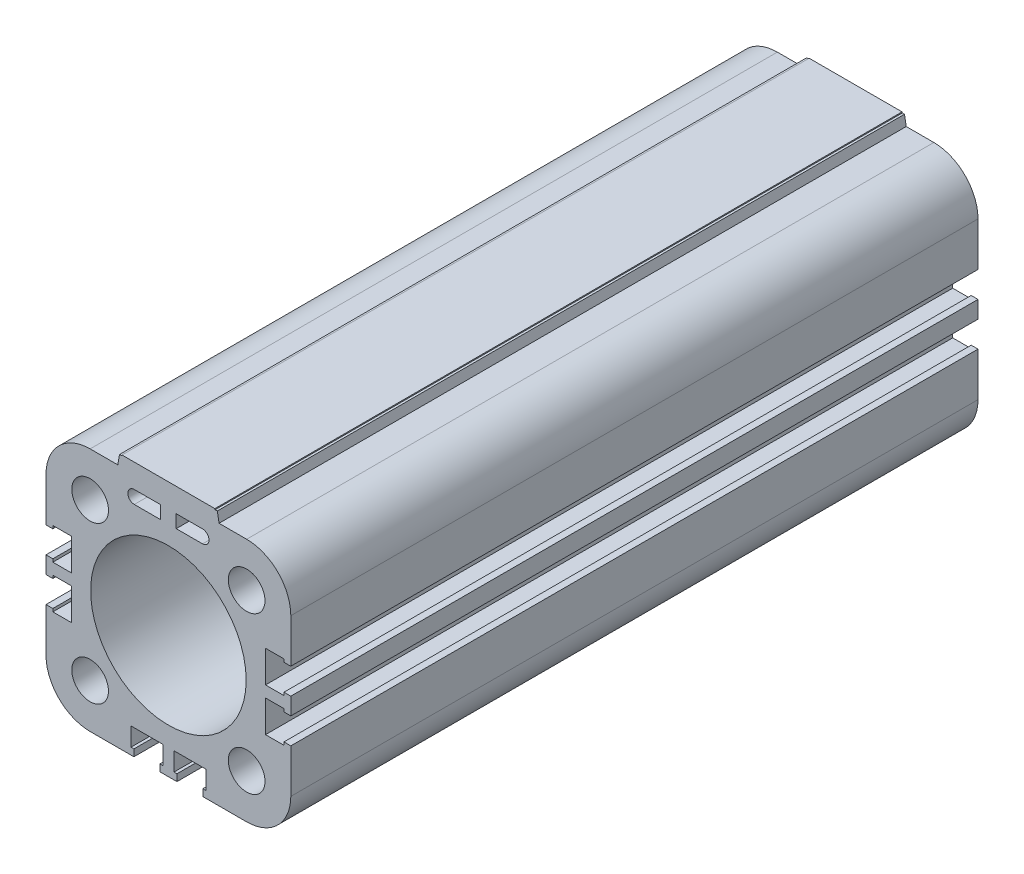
from build123d import *

# Parameters (mm, degrees)
ESQUISSE1_R                         = 3.75
ESQUISSE1_R_2                       = 15.9
EXTRUSION1_DEPTH                    = 70.25
EXTRUSION2_DEPTH                    = 70.25
EXTRUSION2_DEPTH_BACK               = 70.25
ENL_V_MAT_EXTRU_1_DEPTH             = 80.378089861
R_P_TITION_CIRCULAIRE1_COUNT        = 3
R_P_TITION_CIRCULAIRE1_ANGLE        = 180
R_P_TITION_CIRCULAIRE1_COPY_1_DEPTH = 80.378089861
R_P_TITION_CIRCULAIRE1_COPY_2_DEPTH = 80.378089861
ESQUISSE6_W                         = 8.125
ESQUISSE6_H                         = 9.982142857
ENL_V_MAT_EXTRU_3_DEPTH             = 0.2


with BuildPart() as part:
    # Esquisse1 → Extrusion1 (new, symmetric)
    with BuildSketch(Plane.XY):
        with BuildLine():
            Line((-16, 25.025), (-10.1, 25.025))
            Line((-10.1, 25.025), (-9.5, 27.195))
            Line((-9.5, 27.195), (9.5, 27.195))
            Line((9.5, 27.195), (10.1, 25.025))
            Line((10.1, 25.025), (16, 25.025))
            ThreePointArc((16, 25.025), (22.3816387, 22.3816387), (25.025, 16))
            Line((25.025, 16), (25.025, -16))
            ThreePointArc((25.025, -16), (22.3816387, -22.3816387), (16, -25.025))
            Line((16, -25.025), (-16, -25.025))
            ThreePointArc((-16, -25.025), (-22.3816387, -22.3816387), (-25.025, -16))
            Line((-25.025, -16), (-25.025, 16))
            ThreePointArc((-25.025, 16), (-22.3816387, 22.3816387), (-16, 25.025))
        make_face()
        with Locations((-16, 16)):
            Circle(ESQUISSE1_R, mode=Mode.SUBTRACT)
        with Locations((16, 16)):
            Circle(ESQUISSE1_R, mode=Mode.SUBTRACT)
        with Locations((16, -16)):
            Circle(ESQUISSE1_R, mode=Mode.SUBTRACT)
        with Locations((-16, -16)):
            Circle(ESQUISSE1_R, mode=Mode.SUBTRACT)
        Circle(ESQUISSE1_R_2, mode=Mode.SUBTRACT)
        with BuildLine():
            Line((-1.6, 19.695), (-1.6, 22.345))
            Line((-1.6, 22.345), (-6.975, 22.345))
            ThreePointArc((-6.975, 22.345), (-8.3, 21.02), (-6.975, 19.695))
            Line((-6.975, 19.695), (-1.6, 19.695))
        make_face(mode=Mode.SUBTRACT)
        with BuildLine():
            Line((6.975, 19.695), (1.6, 19.695))
            Line((1.6, 19.695), (1.6, 22.345))
            Line((1.6, 22.345), (6.975, 22.345))
            ThreePointArc((6.975, 22.345), (8.3, 21.02), (6.975, 19.695))
        make_face(mode=Mode.SUBTRACT)
    extrude(amount=EXTRUSION1_DEPTH, both=True)

    # Esquisse2 → Extrusion2 (add, two sides: drawn at the far end of the back side and taken through both)
    with BuildSketch(Plane.XY.offset(-EXTRUSION2_DEPTH_BACK)):
        Polygon((-10.352653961, 25.025), (10.352653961, 25.025), (10, 27.025), (-10, 27.025), align=None)
    extrude(amount=EXTRUSION2_DEPTH + EXTRUSION2_DEPTH_BACK)

    # Esquisse3 → Enl_v. mat.-Extru.1 (cut, symmetric)
    with BuildSketch(Plane.XY):
        Polygon((-23.625, 7.05), (-25.025, 7.05), (-25.025, 1.75), (-23.625, 1.75), (-23.625, 1.15), (-19.855, 1.15), (-19.855, 7.65), (-23.625, 7.65), align=None)
    enl_v_mat_extru_1 = extrude(amount=ENL_V_MAT_EXTRU_1_DEPTH, both=True, mode=Mode.SUBTRACT)

    # Sym_trie1: Enl_v. mat.-Extru.1 across plane
    add(enl_v_mat_extru_1.mirror(Plane.ZX), mode=Mode.SUBTRACT)

    # R_p_tition circulaire1: Enl_v. mat.-Extru.1 ×3 about axis
    r_p_tition_circulaire1_axis = Axis((0, 0, 0), (0, 0, 1))
    for i in range(1, R_P_TITION_CIRCULAIRE1_COUNT):
        add(enl_v_mat_extru_1.rotate(r_p_tition_circulaire1_axis, i * R_P_TITION_CIRCULAIRE1_ANGLE / (R_P_TITION_CIRCULAIRE1_COUNT - 1)), mode=Mode.SUBTRACT)

    # R_p_tition circulaire1 copy 1 sketch → R_p_tition circulaire1 copy 1 (cut, symmetric)
    with BuildSketch(Plane(origin=(0, 0, 0), x_dir=(0, 1, 0), z_dir=(0, 0, 1))):
        Polygon((-23.625, -7.05), (-25.025, -7.05), (-25.025, -1.75), (-23.625, -1.75), (-23.625, -1.15), (-19.855, -1.15), (-19.855, -7.65), (-23.625, -7.65), align=None)
    extrude(amount=R_P_TITION_CIRCULAIRE1_COPY_1_DEPTH, both=True, mode=Mode.SUBTRACT)

    # R_p_tition circulaire1 copy 2 sketch → R_p_tition circulaire1 copy 2 (cut, symmetric)
    with BuildSketch(Plane(origin=(0, 0, 0), x_dir=(-1, 0, 0), z_dir=(0, 0, 1))):
        Polygon((-23.625, -7.05), (-25.025, -7.05), (-25.025, -1.75), (-23.625, -1.75), (-23.625, -1.15), (-19.855, -1.15), (-19.855, -7.65), (-23.625, -7.65), align=None)
    extrude(amount=R_P_TITION_CIRCULAIRE1_COPY_2_DEPTH, both=True, mode=Mode.SUBTRACT)

    # Esquisse6 → Enl_v. mat.-Extru.3 (cut)
    # profile 1 of 5: a face of its own
    with BuildSketch(Plane(origin=(0, 27.025, 0), x_dir=(-1, 0, 0), z_dir=(0, 1, 0))):
        with BuildLine():
            add(Edge.make_bspline(
                [(-3.438616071, 50.214285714), (-3.580105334, 50.216678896), (-3.851309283, 50.221266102), (-4.24074045, 50.247413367), (-4.594287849, 50.303208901), (-4.914445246, 50.375041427), (-5.201666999, 50.462491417), (-5.452589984, 50.576363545), (-5.669316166, 50.710839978), (-5.855917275, 50.869478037), (-6.013006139, 51.06101494), (-6.141496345, 51.28952903), (-6.255512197, 51.552761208), (-6.342894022, 51.855597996), (-6.416405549, 52.194665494), (-6.465224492, 52.571990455), (-6.493515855, 52.987468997), (-6.497774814, 53.276830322), (-6.5, 53.428013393)],
                knots=[0, 0, 0, 0, 1.293123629, 2.478634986, 3.563098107, 4.560178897, 5.475689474, 6.301390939, 7.070844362, 7.799472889, 8.529440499, 9.321564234, 10.187672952, 11.145411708, 12.196433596, 13.355863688, 14.618513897, 16, 16, 16, 16], degree=3))
            Line((-6.5, 53.428013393), (-6.5, 63.00390625))
            add(Edge.make_bspline(
                [(-6.5, 63.00390625), (-6.497725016, 63.155084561), (-6.493352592, 63.445642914), (-6.46554192, 63.862384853), (-6.415904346, 64.241982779), (-6.343444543, 64.582486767), (-6.25545719, 64.886395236), (-6.141521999, 65.149670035), (-6.012957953, 65.378084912), (-5.856073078, 65.56994783), (-5.668224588, 65.727790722), (-5.453899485, 65.867421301), (-5.200784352, 65.979080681), (-4.915294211, 66.07272003), (-4.594140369, 66.142790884), (-4.240785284, 66.199145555), (-3.851296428, 66.225125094), (-3.580100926, 66.229736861), (-3.438616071, 66.232142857)],
                knots=[0, 0, 0, 0, 1.378802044, 2.649999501, 3.807176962, 4.866940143, 5.82281813, 6.687244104, 7.477828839, 8.206378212, 8.933591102, 9.707464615, 10.531561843, 11.448680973, 12.443824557, 13.526180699, 14.709388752, 16, 16, 16, 16], degree=3))
            Line((-3.438616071, 66.232142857), (3.326171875, 66.232142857))
            add(Edge.make_bspline(
                [(3.326171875, 66.232142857), (3.473706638, 66.229786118), (3.755781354, 66.225280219), (4.162061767, 66.198694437), (4.530094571, 66.143491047), (4.864367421, 66.072624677), (5.160564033, 65.978839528), (5.423721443, 65.868226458), (5.645669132, 65.728767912), (5.838002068, 65.570182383), (5.997679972, 65.377256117), (6.135942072, 65.151981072), (6.246609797, 64.88538892), (6.341556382, 64.583394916), (6.410663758, 64.241494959), (6.467119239, 63.862802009), (6.492899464, 63.445571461), (6.497569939, 63.155060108), (6.5, 63.00390625)],
                knots=[0, 0, 0, 0, 1.321144, 2.525922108, 3.642027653, 4.650685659, 5.581954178, 6.420654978, 7.198681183, 7.920850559, 8.643019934, 9.430255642, 10.278888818, 11.220482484, 12.260884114, 13.398415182, 14.646388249, 16, 16, 16, 16], degree=3))
            Line((6.5, 63.00390625), (6.5, 53.428013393))
            add(Edge.make_bspline(
                [(6.5, 53.428013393), (6.497619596, 53.276854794), (6.493063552, 52.987540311), (6.466788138, 52.571575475), (6.411179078, 52.195150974), (6.340986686, 51.854696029), (6.246662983, 51.553768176), (6.135917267, 51.287217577), (5.99772663, 51.061843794), (5.837852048, 50.869242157), (5.646735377, 50.709846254), (5.422424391, 50.575608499), (5.161428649, 50.462700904), (4.863543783, 50.375150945), (4.5302406, 50.302497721), (4.162017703, 50.247866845), (3.755794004, 50.221110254), (3.473710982, 50.21662937), (3.326171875, 50.214285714)],
                knots=[0, 0, 0, 0, 1.356177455, 2.595696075, 3.735383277, 4.767150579, 5.710528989, 6.560770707, 7.349498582, 8.073036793, 8.796575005, 9.570395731, 10.410686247, 11.340499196, 12.351069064, 13.469290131, 14.676351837, 16, 16, 16, 16], degree=3))
            Line((3.326171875, 50.214285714), (-3.438616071, 50.214285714))
        make_face()
        with Locations((-0.116071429, 58.223214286)):
            Rectangle(ESQUISSE6_W, ESQUISSE6_H, mode=Mode.SUBTRACT)
    # profile 2 of 5: a face of its own
    with BuildSketch(Plane(origin=(0, 27.025, 0), x_dir=(-1, 0, 0), z_dir=(0, 1, 0))):
        Polygon((-4.178571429, 40.696428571), (6.5, 40.696428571), (6.5, 37.678571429), (-4.178571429, 37.678571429), (-4.178571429, 31.642857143), (-6.5, 31.642857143), (-6.5, 46.732142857), (-4.178571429, 46.732142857), align=None)
    # profile 3 of 5: a face of its own
    with BuildSketch(Plane(origin=(0, 27.025, 0), x_dir=(-1, 0, 0), z_dir=(0, 1, 0))):
        with BuildLine():
            Line((-4.178571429, 26.071428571), (-4.178571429, 17.482142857))
            Line((-4.178571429, 17.482142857), (-1.392857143, 17.482142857))
            Line((-1.392857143, 17.482142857), (-1.392857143, 25.661551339))
            add(Edge.make_bspline(
                [(-1.392857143, 25.661551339), (-1.390578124, 25.811517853), (-1.386199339, 26.099655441), (-1.358467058, 26.512819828), (-1.308769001, 26.887498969), (-1.237345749, 27.224045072), (-1.142540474, 27.522292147), (-1.032955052, 27.78626729), (-0.896885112, 28.009916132), (-0.741834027, 28.202078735), (-0.554277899, 28.361546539), (-0.334432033, 28.495217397), (-0.079220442, 28.607807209), (0.208529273, 28.701678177), (0.533952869, 28.767353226), (0.89054449, 28.824116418), (1.284875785, 28.850101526), (1.55848086, 28.854729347), (1.701171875, 28.857142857)],
                knots=[0, 0, 0, 0, 1.367798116, 2.628013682, 3.774280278, 4.812497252, 5.761110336, 6.625549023, 7.412290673, 8.140850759, 8.868074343, 9.645408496, 10.479564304, 11.407178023, 12.399950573, 13.504123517, 14.698345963, 16, 16, 16, 16], degree=3))
            Line((1.701171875, 28.857142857), (3.376953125, 28.857142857))
            add(Edge.make_bspline(
                [(3.376953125, 28.857142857), (3.520848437, 28.854709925), (3.79685956, 28.850043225), (4.194864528, 28.824289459), (4.556041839, 28.76652153), (4.884621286, 28.703614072), (5.173727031, 28.60623231), (5.430412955, 28.495144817), (5.653883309, 28.362799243), (5.84137342, 28.200775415), (6.001128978, 28.011412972), (6.135214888, 27.785113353), (6.251735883, 27.524022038), (6.339469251, 27.22313065), (6.411698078, 26.887356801), (6.46687929, 26.513134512), (6.492976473, 26.099613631), (6.497595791, 25.811503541), (6.5, 25.661551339)],
                knots=[0, 0, 0, 0, 1.306697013, 2.506425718, 3.616422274, 4.626141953, 5.53909588, 6.379476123, 7.162633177, 7.886543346, 8.618811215, 9.401968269, 10.26686813, 11.207899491, 12.241386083, 13.383960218, 14.63843392, 16, 16, 16, 16], degree=3))
            Line((6.5, 25.661551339), (6.5, 17.558314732))
            add(Edge.make_bspline(
                [(6.5, 17.558314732), (6.497639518, 17.402313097), (6.493115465, 17.10332338), (6.466482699, 16.672996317), (6.412069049, 16.282947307), (6.338987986, 15.931746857), (6.253298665, 15.618111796), (6.134003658, 15.347349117), (6.002154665, 15.1116395), (5.842710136, 14.914109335), (5.653010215, 14.748849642), (5.431897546, 14.60789417), (5.17373814, 14.494107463), (4.88488824, 14.39299125), (4.556504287, 14.325089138), (4.194622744, 14.270112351), (3.797075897, 14.237790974), (3.520890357, 14.234077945), (3.376953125, 14.232142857)],
                knots=[0, 0, 0, 0, 1.387524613, 2.659302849, 3.831785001, 4.886246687, 5.849294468, 6.716236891, 7.511166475, 8.245060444, 8.961252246, 9.739794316, 10.56743361, 11.465172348, 12.456558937, 13.543898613, 14.719974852, 16, 16, 16, 16], degree=3))
            Line((3.376953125, 14.232142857), (3.054129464, 14.232142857))
            Line((3.054129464, 14.232142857), (2.553571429, 17.017857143))
            Line((2.553571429, 17.017857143), (3.946428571, 17.017857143))
            Line((3.946428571, 17.017857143), (3.946428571, 26.071428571))
            Line((3.946428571, 26.071428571), (1.160714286, 26.071428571))
            Line((1.160714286, 26.071428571), (1.160714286, 18.066127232))
            add(Edge.make_bspline(
                [(1.160714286, 18.066127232), (1.158316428, 17.907716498), (1.153717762, 17.603912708), (1.127601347, 17.167436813), (1.072091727, 16.772879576), (1.001695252, 16.416764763), (0.906811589, 16.101739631), (0.798661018, 15.821855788), (0.657029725, 15.58779535), (0.500339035, 15.384274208), (0.308073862, 15.219103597), (0.087787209, 15.073779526), (-0.173057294, 14.962125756), (-0.464707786, 14.862436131), (-0.793068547, 14.787956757), (-1.156831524, 14.734595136), (-1.556701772, 14.702003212), (-1.835315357, 14.69833806), (-1.98046875, 14.696428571)],
                knots=[0, 0, 0, 0, 1.39533835, 2.67601234, 3.847653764, 4.902299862, 5.869218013, 6.743250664, 7.535841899, 8.270907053, 8.995171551, 9.757201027, 10.586497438, 11.485598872, 12.469720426, 13.546498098, 14.721763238, 16, 16, 16, 16], degree=3))
            Line((-1.98046875, 14.696428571), (-3.424107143, 14.696428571))
            add(Edge.make_bspline(
                [(-3.424107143, 14.696428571), (-3.565635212, 14.698359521), (-3.838214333, 14.702078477), (-4.229621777, 14.734611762), (-4.586239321, 14.787742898), (-4.908264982, 14.863173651), (-5.194565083, 14.961097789), (-5.449717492, 15.074818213), (-5.665726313, 15.21903507), (-5.854212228, 15.384522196), (-6.007467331, 15.58791931), (-6.144298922, 15.822976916), (-6.254654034, 16.100944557), (-6.342975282, 16.417575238), (-6.416574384, 16.772432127), (-6.465317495, 17.167830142), (-6.493455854, 17.603845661), (-6.497757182, 17.90769352), (-6.5, 18.066127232)],
                knots=[0, 0, 0, 0, 1.258701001, 2.424223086, 3.490447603, 4.463426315, 5.361289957, 6.179275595, 6.939892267, 7.66333355, 8.399060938, 9.194101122, 10.07682987, 11.050343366, 12.115482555, 13.297362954, 14.590778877, 16, 16, 16, 16], degree=3))
            Line((-6.5, 18.066127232), (-6.5, 25.512834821))
            add(Edge.make_bspline(
                [(-6.5, 25.512834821), (-6.497809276, 25.665227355), (-6.493597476, 25.958211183), (-6.464662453, 26.378345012), (-6.418669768, 26.762580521), (-6.352290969, 27.1102223), (-6.259679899, 27.419658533), (-6.157163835, 27.695263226), (-6.030005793, 27.933904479), (-5.878521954, 28.13825596), (-5.701105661, 28.312236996), (-5.494288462, 28.457853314), (-5.25916822, 28.582286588), (-4.992111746, 28.683216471), (-4.695242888, 28.761010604), (-4.369214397, 28.820147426), (-4.012330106, 28.851226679), (-3.763912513, 28.855116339), (-3.634486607, 28.857142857)],
                knots=[0, 0, 0, 0, 1.415290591, 2.720981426, 3.909058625, 5.007980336, 6.002897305, 6.905860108, 7.734851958, 8.505184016, 9.259554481, 10.032338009, 10.846131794, 11.724100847, 12.677466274, 13.69289398, 14.7979946, 16, 16, 16, 16], degree=3))
            Line((-3.634486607, 28.857142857), (-3.376953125, 28.857142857))
            Line((-3.376953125, 28.857142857), (-2.785714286, 26.071428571))
            Line((-2.785714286, 26.071428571), (-4.178571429, 26.071428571))
        make_face()
    # profile 4 of 5: a face of its own
    with BuildSketch(Plane(origin=(0, 27.025, 0), x_dir=(-1, 0, 0), z_dir=(0, 1, 0))):
        Polygon((6.5, -4.571428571), (-6.5, -4.571428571), (-6.5, 8.660714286), (-4.178571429, 8.660714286), (-4.178571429, -1.553571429), (-1.625, -1.553571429), (-1.625, 4.482142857), (0.696428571, 4.482142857), (0.696428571, -1.553571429), (3.946428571, -1.553571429), (3.946428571, 8.892857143), (6.5, 8.892857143), align=None)
    # profile 5 of 5: a face of its own
    with BuildSketch(Plane(origin=(0, 27.025, 0), x_dir=(-1, 0, 0), z_dir=(0, 1, 0))):
        Polygon((6.5, -21.285714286), (-6.5, -21.285714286), (-6.5, -8.285714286), (-4.178571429, -8.285714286), (-4.178571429, -18.267857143), (-0.696428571, -18.267857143), (-0.696428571, -12.928571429), (1.625, -12.928571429), (1.625, -18.267857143), (6.5, -18.267857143), align=None)
    extrude(amount=-ENL_V_MAT_EXTRU_3_DEPTH, mode=Mode.SUBTRACT)


solid = part.part
